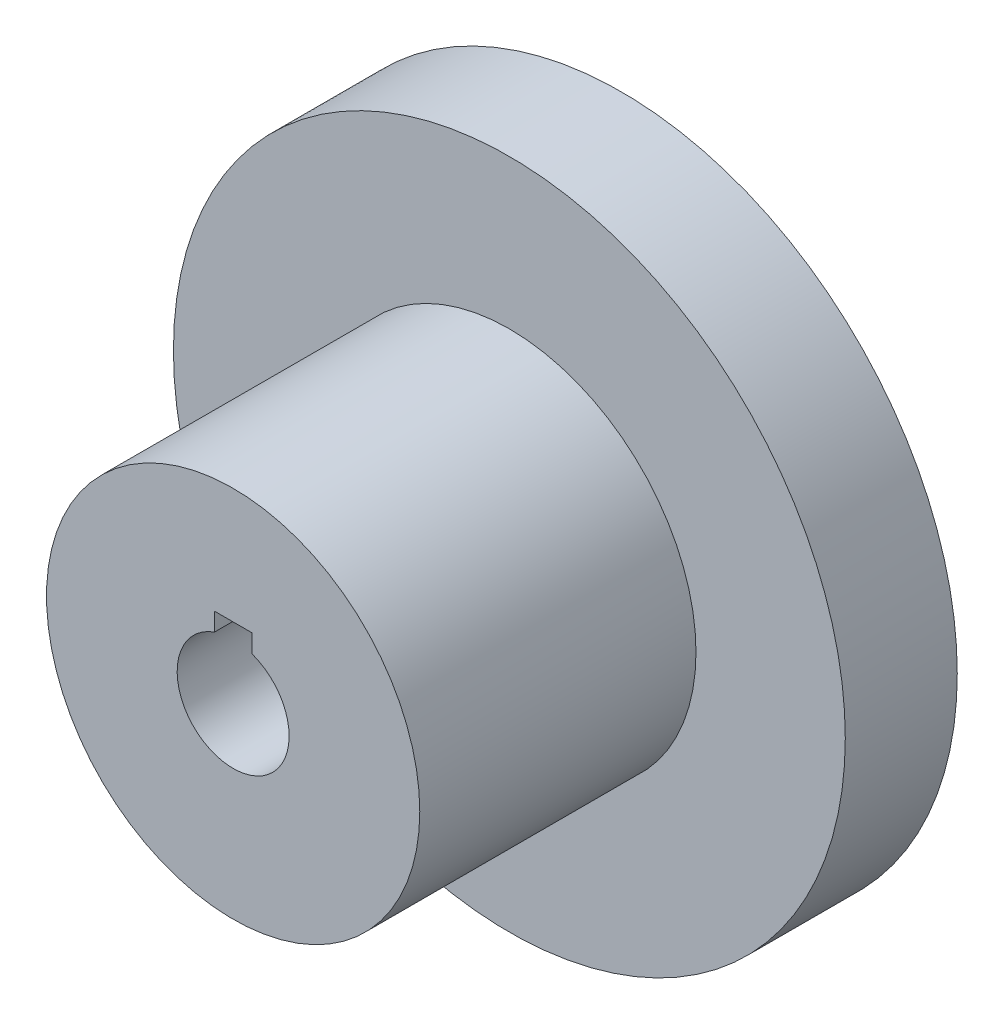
ISO-10303-21;
HEADER;
FILE_DESCRIPTION(('STEP AP214'),'2;1');
FILE_NAME('part.step','',(''),(''),'','','');
FILE_SCHEMA(('AUTOMOTIVE_DESIGN { 1 0 10303 214 1 1 1 1 }'));
ENDSEC;
DATA;
#1=APPLICATION_CONTEXT('core data for automotive mechanical design processes');
#2=APPLICATION_PROTOCOL_DEFINITION('international standard','automotive_design',2000,#1);
#3=PRODUCT_CONTEXT('',#1,'mechanical');
#4=PRODUCT('Part','Part','',(#3));
#5=PRODUCT_RELATED_PRODUCT_CATEGORY('part','',(#4));
#6=PRODUCT_DEFINITION_FORMATION('','',#4);
#7=PRODUCT_DEFINITION_CONTEXT('part definition',#1,'design');
#8=PRODUCT_DEFINITION('design','',#6,#7);
#9=PRODUCT_DEFINITION_SHAPE('','',#8);
#10=(LENGTH_UNIT() NAMED_UNIT(*) SI_UNIT(.MILLI.,.METRE.));
#11=(NAMED_UNIT(*) PLANE_ANGLE_UNIT() SI_UNIT($,.RADIAN.));
#12=(NAMED_UNIT(*) SI_UNIT($,.STERADIAN.) SOLID_ANGLE_UNIT());
#13=UNCERTAINTY_MEASURE_WITH_UNIT(LENGTH_MEASURE(1.E-05),#10,'distance_accuracy_value','');
#14=(GEOMETRIC_REPRESENTATION_CONTEXT(3) GLOBAL_UNCERTAINTY_ASSIGNED_CONTEXT((#13)) GLOBAL_UNIT_ASSIGNED_CONTEXT((#10,
#11,#12)) REPRESENTATION_CONTEXT('',''));
#15=CARTESIAN_POINT('',(0.,0.,0.));
#16=DIRECTION('',(0.,0.,1.));
#17=DIRECTION('',(1.,0.,0.));
#18=AXIS2_PLACEMENT_3D('',#15,#16,#17);
#19=CARTESIAN_POINT('',(0.,0.,-46.99));
#20=DIRECTION('',(0.,0.,1.));
#21=DIRECTION('',(1.,0.,0.));
#22=AXIS2_PLACEMENT_3D('',#19,#20,#21);
#23=CYLINDRICAL_SURFACE('',#22,31.75);
#24=CARTESIAN_POINT('',(0.,0.,-46.99));
#25=DIRECTION('',(0.,0.,-1.));
#26=DIRECTION('',(-1.,0.,0.));
#27=AXIS2_PLACEMENT_3D('',#24,#25,#26);
#28=CIRCLE('',#27,31.75);
#29=CARTESIAN_POINT('',(-31.75,0.,-46.99));
#30=VERTEX_POINT('',#29);
#31=EDGE_CURVE('E112',#30,#30,#28,.F.);
#32=ORIENTED_EDGE('',*,*,#31,.T.);
#33=EDGE_LOOP('',(#32));
#34=FACE_BOUND('',#33,.T.);
#35=CARTESIAN_POINT('',(0.,0.,0.));
#36=DIRECTION('',(0.,0.,1.));
#37=DIRECTION('',(1.,0.,0.));
#38=AXIS2_PLACEMENT_3D('',#35,#36,#37);
#39=CIRCLE('',#38,31.75);
#40=CARTESIAN_POINT('',(31.75,0.,0.));
#41=VERTEX_POINT('',#40);
#42=EDGE_CURVE('E115',#41,#41,#39,.T.);
#43=ORIENTED_EDGE('',*,*,#42,.F.);
#44=EDGE_LOOP('',(#43));
#45=FACE_BOUND('',#44,.T.);
#46=ADVANCED_FACE('F33',(#34,#45),#23,.T.);
#47=CARTESIAN_POINT('',(0.,0.,0.));
#48=DIRECTION('',(0.,0.,1.));
#49=DIRECTION('',(1.,0.,0.));
#50=AXIS2_PLACEMENT_3D('',#47,#48,#49);
#51=PLANE('',#50);
#52=DIRECTION('',(0.,-1.,0.));
#53=VECTOR('',#52,1.);
#54=CARTESIAN_POINT('',(-3.175,12.065,0.));
#55=LINE('',#54,#53);
#56=CARTESIAN_POINT('',(-3.175,12.065,0.));
#57=VERTEX_POINT('',#56);
#58=CARTESIAN_POINT('',(-3.175,8.98025612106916,0.));
#59=VERTEX_POINT('',#58);
#60=EDGE_CURVE('E47',#57,#59,#55,.T.);
#61=ORIENTED_EDGE('',*,*,#60,.F.);
#62=DIRECTION('',(-1.,0.,0.));
#63=VECTOR('',#62,1.);
#64=CARTESIAN_POINT('',(-3.175,12.065,0.));
#65=LINE('',#64,#63);
#66=CARTESIAN_POINT('',(3.175,12.065,0.));
#67=VERTEX_POINT('',#66);
#68=EDGE_CURVE('E91',#67,#57,#65,.T.);
#69=ORIENTED_EDGE('',*,*,#68,.F.);
#70=DIRECTION('',(0.,1.,0.));
#71=VECTOR('',#70,1.);
#72=CARTESIAN_POINT('',(3.175,12.065,0.));
#73=LINE('',#72,#71);
#74=CARTESIAN_POINT('',(3.175,8.98025612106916,0.));
#75=VERTEX_POINT('',#74);
#76=EDGE_CURVE('E75',#75,#67,#73,.T.);
#77=ORIENTED_EDGE('',*,*,#76,.F.);
#78=CARTESIAN_POINT('',(0.,0.,0.));
#79=DIRECTION('',(0.,0.,1.));
#80=DIRECTION('',(1.,0.,0.));
#81=AXIS2_PLACEMENT_3D('',#78,#79,#80);
#82=CIRCLE('',#81,9.525);
#83=EDGE_CURVE('E84',#59,#75,#82,.T.);
#84=ORIENTED_EDGE('',*,*,#83,.F.);
#85=EDGE_LOOP('',(#61,#69,#77,#84));
#86=FACE_BOUND('',#85,.T.);
#87=ORIENTED_EDGE('',*,*,#42,.T.);
#88=EDGE_LOOP('',(#87));
#89=FACE_BOUND('',#88,.T.);
#90=ADVANCED_FACE('F88',(#86,#89),#51,.T.);
#91=CARTESIAN_POINT('',(0.,0.,-66.04));
#92=DIRECTION('',(0.,0.,1.));
#93=DIRECTION('',(1.,0.,0.));
#94=AXIS2_PLACEMENT_3D('',#91,#92,#93);
#95=CYLINDRICAL_SURFACE('',#94,57.15);
#96=CARTESIAN_POINT('',(0.,0.,-66.04));
#97=DIRECTION('',(0.,0.,-1.));
#98=DIRECTION('',(-1.,0.,0.));
#99=AXIS2_PLACEMENT_3D('',#96,#97,#98);
#100=CIRCLE('',#99,57.15);
#101=CARTESIAN_POINT('',(-57.15,0.,-66.04));
#102=VERTEX_POINT('',#101);
#103=EDGE_CURVE('E109',#102,#102,#100,.T.);
#104=ORIENTED_EDGE('',*,*,#103,.F.);
#105=EDGE_LOOP('',(#104));
#106=FACE_BOUND('',#105,.T.);
#107=CARTESIAN_POINT('',(0.,0.,-46.99));
#108=DIRECTION('',(0.,0.,-1.));
#109=DIRECTION('',(-1.,0.,0.));
#110=AXIS2_PLACEMENT_3D('',#107,#108,#109);
#111=CIRCLE('',#110,57.15);
#112=CARTESIAN_POINT('',(-57.15,0.,-46.99));
#113=VERTEX_POINT('',#112);
#114=EDGE_CURVE('E106',#113,#113,#111,.T.);
#115=ORIENTED_EDGE('',*,*,#114,.T.);
#116=EDGE_LOOP('',(#115));
#117=FACE_BOUND('',#116,.T.);
#118=ADVANCED_FACE('F144',(#106,#117),#95,.T.);
#119=CARTESIAN_POINT('',(0.,0.,-66.04));
#120=DIRECTION('',(0.,0.,-1.));
#121=DIRECTION('',(-1.,0.,0.));
#122=AXIS2_PLACEMENT_3D('',#119,#120,#121);
#123=PLANE('',#122);
#124=CARTESIAN_POINT('',(0.,0.,-66.04));
#125=DIRECTION('',(0.,0.,-1.));
#126=DIRECTION('',(-1.,0.,0.));
#127=AXIS2_PLACEMENT_3D('',#124,#125,#126);
#128=CIRCLE('',#127,47.625);
#129=CARTESIAN_POINT('',(-47.625,0.,-66.04));
#130=VERTEX_POINT('',#129);
#131=EDGE_CURVE('E98',#130,#130,#128,.T.);
#132=ORIENTED_EDGE('',*,*,#131,.F.);
#133=EDGE_LOOP('',(#132));
#134=FACE_BOUND('',#133,.T.);
#135=ORIENTED_EDGE('',*,*,#103,.T.);
#136=EDGE_LOOP('',(#135));
#137=FACE_BOUND('',#136,.T.);
#138=ADVANCED_FACE('F152',(#134,#137),#123,.T.);
#139=CARTESIAN_POINT('',(0.,0.,-46.99));
#140=DIRECTION('',(0.,0.,-1.));
#141=DIRECTION('',(-1.,0.,0.));
#142=AXIS2_PLACEMENT_3D('',#139,#140,#141);
#143=PLANE('',#142);
#144=ORIENTED_EDGE('',*,*,#31,.F.);
#145=EDGE_LOOP('',(#144));
#146=FACE_BOUND('',#145,.T.);
#147=ORIENTED_EDGE('',*,*,#114,.F.);
#148=EDGE_LOOP('',(#147));
#149=FACE_BOUND('',#148,.T.);
#150=ADVANCED_FACE('F149',(#146,#149),#143,.F.);
#151=CARTESIAN_POINT('',(0.,0.,87.7138418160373));
#152=DIRECTION('',(0.,0.,-1.));
#153=DIRECTION('',(-1.,0.,0.));
#154=AXIS2_PLACEMENT_3D('',#151,#152,#153);
#155=CYLINDRICAL_SURFACE('',#154,47.625);
#156=CARTESIAN_POINT('',(0.,0.,-53.34));
#157=DIRECTION('',(0.,0.,-1.));
#158=DIRECTION('',(-1.,0.,0.));
#159=AXIS2_PLACEMENT_3D('',#156,#157,#158);
#160=CIRCLE('',#159,47.625);
#161=CARTESIAN_POINT('',(-47.625,0.,-53.34));
#162=VERTEX_POINT('',#161);
#163=EDGE_CURVE('E103',#162,#162,#160,.F.);
#164=ORIENTED_EDGE('',*,*,#163,.T.);
#165=EDGE_LOOP('',(#164));
#166=FACE_BOUND('',#165,.T.);
#167=ORIENTED_EDGE('',*,*,#131,.T.);
#168=EDGE_LOOP('',(#167));
#169=FACE_BOUND('',#168,.T.);
#170=ADVANCED_FACE('F136',(#166,#169),#155,.F.);
#171=CARTESIAN_POINT('',(0.,0.,-53.34));
#172=DIRECTION('',(0.,0.,-1.));
#173=DIRECTION('',(-1.,0.,0.));
#174=AXIS2_PLACEMENT_3D('',#171,#172,#173);
#175=PLANE('',#174);
#176=DIRECTION('',(0.,1.,0.));
#177=VECTOR('',#176,1.);
#178=CARTESIAN_POINT('',(-3.175,0.,-53.34));
#179=LINE('',#178,#177);
#180=CARTESIAN_POINT('',(-3.175,8.98025612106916,-53.34));
#181=VERTEX_POINT('',#180);
#182=CARTESIAN_POINT('',(-3.175,12.065,-53.34));
#183=VERTEX_POINT('',#182);
#184=EDGE_CURVE('E11',#181,#183,#179,.T.);
#185=ORIENTED_EDGE('',*,*,#184,.F.);
#186=CARTESIAN_POINT('',(0.,0.,-53.34));
#187=DIRECTION('',(0.,0.,-1.));
#188=DIRECTION('',(-1.,0.,0.));
#189=AXIS2_PLACEMENT_3D('',#186,#187,#188);
#190=CIRCLE('',#189,9.525);
#191=CARTESIAN_POINT('',(3.175,8.98025612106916,-53.34));
#192=VERTEX_POINT('',#191);
#193=EDGE_CURVE('E118',#192,#181,#190,.T.);
#194=ORIENTED_EDGE('',*,*,#193,.F.);
#195=DIRECTION('',(0.,-1.,0.));
#196=VECTOR('',#195,1.);
#197=CARTESIAN_POINT('',(3.175,0.,-53.34));
#198=LINE('',#197,#196);
#199=CARTESIAN_POINT('',(3.175,12.065,-53.34));
#200=VERTEX_POINT('',#199);
#201=EDGE_CURVE('E78',#200,#192,#198,.T.);
#202=ORIENTED_EDGE('',*,*,#201,.F.);
#203=DIRECTION('',(1.,0.,0.));
#204=VECTOR('',#203,1.);
#205=CARTESIAN_POINT('',(0.,12.065,-53.34));
#206=LINE('',#205,#204);
#207=EDGE_CURVE('E40',#183,#200,#206,.T.);
#208=ORIENTED_EDGE('',*,*,#207,.F.);
#209=EDGE_LOOP('',(#185,#194,#202,#208));
#210=FACE_BOUND('',#209,.T.);
#211=ORIENTED_EDGE('',*,*,#163,.F.);
#212=EDGE_LOOP('',(#211));
#213=FACE_BOUND('',#212,.T.);
#214=ADVANCED_FACE('F126',(#210,#213),#175,.T.);
#215=CARTESIAN_POINT('',(-3.175,12.065,-66.04));
#216=DIRECTION('',(-1.,0.,0.));
#217=DIRECTION('',(0.,0.,1.));
#218=AXIS2_PLACEMENT_3D('',#215,#216,#217);
#219=PLANE('',#218);
#220=ORIENTED_EDGE('',*,*,#184,.T.);
#221=DIRECTION('',(0.,0.,1.));
#222=VECTOR('',#221,1.);
#223=CARTESIAN_POINT('',(-3.175,12.065,-66.04));
#224=LINE('',#223,#222);
#225=EDGE_CURVE('E96',#183,#57,#224,.T.);
#226=ORIENTED_EDGE('',*,*,#225,.T.);
#227=ORIENTED_EDGE('',*,*,#60,.T.);
#228=DIRECTION('',(0.,0.,1.));
#229=VECTOR('',#228,1.);
#230=CARTESIAN_POINT('',(-3.175,8.98025612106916,-66.04));
#231=LINE('',#230,#229);
#232=EDGE_CURVE('E81',#181,#59,#231,.T.);
#233=ORIENTED_EDGE('',*,*,#232,.F.);
#234=EDGE_LOOP('',(#220,#226,#227,#233));
#235=FACE_BOUND('',#234,.T.);
#236=ADVANCED_FACE('F128',(#235),#219,.F.);
#237=CARTESIAN_POINT('',(-3.175,12.065,-66.04));
#238=DIRECTION('',(0.,1.,0.));
#239=DIRECTION('',(0.,0.,1.));
#240=AXIS2_PLACEMENT_3D('',#237,#238,#239);
#241=PLANE('',#240);
#242=ORIENTED_EDGE('',*,*,#207,.T.);
#243=DIRECTION('',(0.,0.,1.));
#244=VECTOR('',#243,1.);
#245=CARTESIAN_POINT('',(3.175,12.065,-66.04));
#246=LINE('',#245,#244);
#247=EDGE_CURVE('E80',#200,#67,#246,.T.);
#248=ORIENTED_EDGE('',*,*,#247,.T.);
#249=ORIENTED_EDGE('',*,*,#68,.T.);
#250=ORIENTED_EDGE('',*,*,#225,.F.);
#251=EDGE_LOOP('',(#242,#248,#249,#250));
#252=FACE_BOUND('',#251,.T.);
#253=ADVANCED_FACE('F123',(#252),#241,.F.);
#254=CARTESIAN_POINT('',(3.175,12.065,-66.04));
#255=DIRECTION('',(1.,0.,0.));
#256=DIRECTION('',(0.,1.,0.));
#257=AXIS2_PLACEMENT_3D('',#254,#255,#256);
#258=PLANE('',#257);
#259=ORIENTED_EDGE('',*,*,#201,.T.);
#260=DIRECTION('',(0.,0.,1.));
#261=VECTOR('',#260,1.);
#262=CARTESIAN_POINT('',(3.175,8.98025612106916,-66.04));
#263=LINE('',#262,#261);
#264=EDGE_CURVE('E55',#192,#75,#263,.T.);
#265=ORIENTED_EDGE('',*,*,#264,.T.);
#266=ORIENTED_EDGE('',*,*,#76,.T.);
#267=ORIENTED_EDGE('',*,*,#247,.F.);
#268=EDGE_LOOP('',(#259,#265,#266,#267));
#269=FACE_BOUND('',#268,.T.);
#270=ADVANCED_FACE('F72',(#269),#258,.F.);
#271=CARTESIAN_POINT('',(0.,0.,-66.04));
#272=DIRECTION('',(0.,0.,1.));
#273=DIRECTION('',(1.,0.,0.));
#274=AXIS2_PLACEMENT_3D('',#271,#272,#273);
#275=CYLINDRICAL_SURFACE('',#274,9.525);
#276=ORIENTED_EDGE('',*,*,#193,.T.);
#277=ORIENTED_EDGE('',*,*,#232,.T.);
#278=ORIENTED_EDGE('',*,*,#83,.T.);
#279=ORIENTED_EDGE('',*,*,#264,.F.);
#280=EDGE_LOOP('',(#276,#277,#278,#279));
#281=FACE_BOUND('',#280,.T.);
#282=ADVANCED_FACE('F85',(#281),#275,.F.);
#283=CLOSED_SHELL('',(#46,#90,#118,#138,#150,#170,#214,#236,#253,#270,#282));
#284=MANIFOLD_SOLID_BREP('B2',#283);
#285=ADVANCED_BREP_SHAPE_REPRESENTATION('',(#18,#284),#14);
#286=SHAPE_DEFINITION_REPRESENTATION(#9,#285);
ENDSEC;
END-ISO-10303-21;
